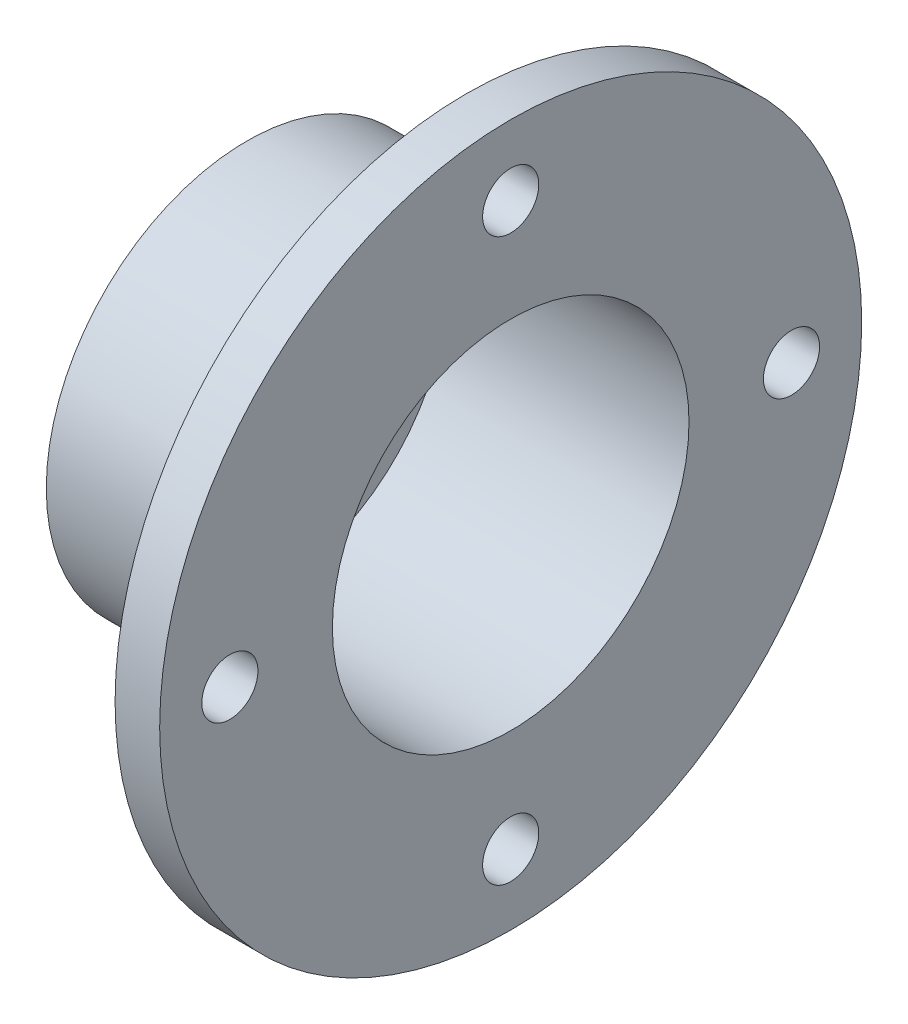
from build123d import *

# Parameters (mm, degrees)
CUT_EXTRUDE1_REACH = 40.649
SKETCH2_R          = 2


with BuildPart() as part:
    # Sketch1 → Revolve1 (revolve)
    with BuildSketch(Plane.XY, mode=Mode.PRIVATE) as revolve1_sk:
        Polygon((0, 9.525), (0, 14.2875), (15.6125, 14.2875), (15.6125, 25), (18.7875, 25), (18.7875, 12.7), (1.5875, 12.7), (1.5875, 9.525), align=None)
    revolve(revolve1_sk.sketch.rotate(Axis((0, 0, 0), (1, 0, 0)), 90), axis=Axis((0, 0, 0), (1, 0, 0)))

    # Sketch2 → Cut-Extrude1 (cut, up to next)
    with BuildSketch(Plane.ZY.offset(-15.6125), mode=Mode.PRIVATE) as cut_extrude1_sk1:
        with Locations((0, 20)):
            Circle(SKETCH2_R)
    cut_extrude1_tool1 = extrude(cut_extrude1_sk1.sketch, amount=-CUT_EXTRUDE1_REACH, mode=Mode.PRIVATE) & part.part
    # Sketch2 → Cut-Extrude1 (cut, up to next)
    with BuildSketch(Plane.ZY.offset(-15.6125), mode=Mode.PRIVATE) as cut_extrude1_sk2:
        with Locations((-20, 0)):
            Circle(SKETCH2_R)
    cut_extrude1_tool2 = extrude(cut_extrude1_sk2.sketch, amount=-CUT_EXTRUDE1_REACH, mode=Mode.PRIVATE) & part.part
    # Sketch2 → Cut-Extrude1 (cut, up to next)
    with BuildSketch(Plane.ZY.offset(-15.6125), mode=Mode.PRIVATE) as cut_extrude1_sk3:
        with Locations((0, -20)):
            Circle(SKETCH2_R)
    cut_extrude1_tool3 = extrude(cut_extrude1_sk3.sketch, amount=-CUT_EXTRUDE1_REACH, mode=Mode.PRIVATE) & part.part
    # Sketch2 → Cut-Extrude1 (cut, up to next)
    with BuildSketch(Plane.ZY.offset(-15.6125), mode=Mode.PRIVATE) as cut_extrude1_sk4:
        with Locations((20, 0)):
            Circle(SKETCH2_R)
    cut_extrude1_tool4 = extrude(cut_extrude1_sk4.sketch, amount=-CUT_EXTRUDE1_REACH, mode=Mode.PRIVATE) & part.part
    add(cut_extrude1_tool1.solids().sort_by_distance((15.6125, 20, 0))[0], mode=Mode.SUBTRACT)
    add(cut_extrude1_tool2.solids().sort_by_distance((15.6125, 0, -20))[0], mode=Mode.SUBTRACT)
    add(cut_extrude1_tool3.solids().sort_by_distance((15.6125, -20, 0))[0], mode=Mode.SUBTRACT)
    add(cut_extrude1_tool4.solids().sort_by_distance((15.6125, 0, 20))[0], mode=Mode.SUBTRACT)


solid = part.part
